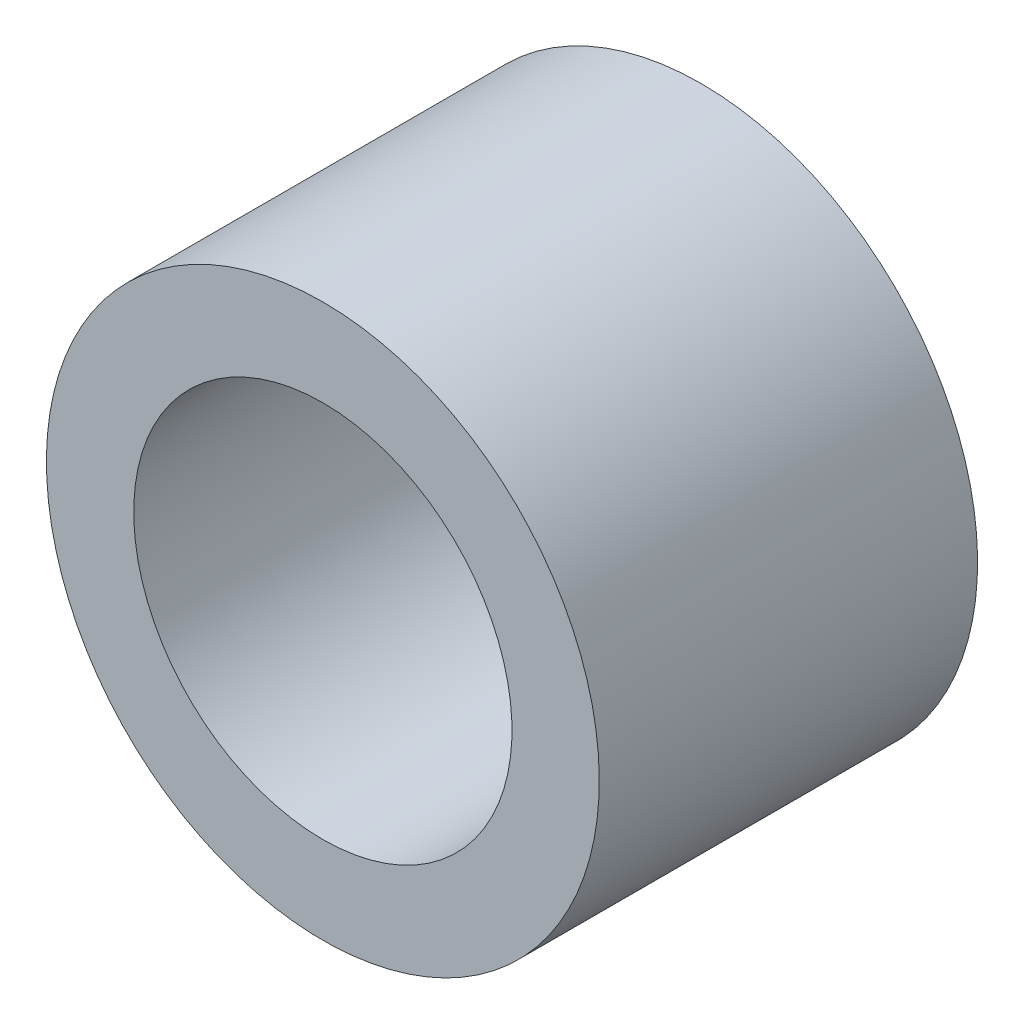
ISO-10303-21;
HEADER;
FILE_DESCRIPTION(('STEP AP214'),'2;1');
FILE_NAME('part.step','',(''),(''),'','','');
FILE_SCHEMA(('AUTOMOTIVE_DESIGN { 1 0 10303 214 1 1 1 1 }'));
ENDSEC;
DATA;
#1=APPLICATION_CONTEXT('core data for automotive mechanical design processes');
#2=APPLICATION_PROTOCOL_DEFINITION('international standard','automotive_design',2000,#1);
#3=PRODUCT_CONTEXT('',#1,'mechanical');
#4=PRODUCT('Part','Part','',(#3));
#5=PRODUCT_RELATED_PRODUCT_CATEGORY('part','',(#4));
#6=PRODUCT_DEFINITION_FORMATION('','',#4);
#7=PRODUCT_DEFINITION_CONTEXT('part definition',#1,'design');
#8=PRODUCT_DEFINITION('design','',#6,#7);
#9=PRODUCT_DEFINITION_SHAPE('','',#8);
#10=(LENGTH_UNIT() NAMED_UNIT(*) SI_UNIT(.MILLI.,.METRE.));
#11=(NAMED_UNIT(*) PLANE_ANGLE_UNIT() SI_UNIT($,.RADIAN.));
#12=(NAMED_UNIT(*) SI_UNIT($,.STERADIAN.) SOLID_ANGLE_UNIT());
#13=UNCERTAINTY_MEASURE_WITH_UNIT(LENGTH_MEASURE(1.E-05),#10,'distance_accuracy_value','');
#14=(GEOMETRIC_REPRESENTATION_CONTEXT(3) GLOBAL_UNCERTAINTY_ASSIGNED_CONTEXT((#13)) GLOBAL_UNIT_ASSIGNED_CONTEXT((#10,
#11,#12)) REPRESENTATION_CONTEXT('',''));
#15=CARTESIAN_POINT('',(0.,0.,0.));
#16=DIRECTION('',(0.,0.,1.));
#17=DIRECTION('',(1.,0.,0.));
#18=AXIS2_PLACEMENT_3D('',#15,#16,#17);
#19=CARTESIAN_POINT('',(9.5,0.,0.));
#20=DIRECTION('',(0.,0.,1.));
#21=DIRECTION('',(0.,-1.,0.));
#22=AXIS2_PLACEMENT_3D('',#19,#20,#21);
#23=PLANE('',#22);
#24=CARTESIAN_POINT('',(0.,0.,0.));
#25=DIRECTION('',(0.,0.,1.));
#26=DIRECTION('',(0.,-1.,0.));
#27=AXIS2_PLACEMENT_3D('',#24,#25,#26);
#28=CIRCLE('',#27,6.5);
#29=CARTESIAN_POINT('',(0.,-6.5,0.));
#30=VERTEX_POINT('',#29);
#31=EDGE_CURVE('E22',#30,#30,#28,.T.);
#32=ORIENTED_EDGE('',*,*,#31,.T.);
#33=EDGE_LOOP('',(#32));
#34=FACE_BOUND('',#33,.T.);
#35=CARTESIAN_POINT('',(0.,0.,0.));
#36=DIRECTION('',(0.,0.,-1.));
#37=DIRECTION('',(0.,1.,0.));
#38=AXIS2_PLACEMENT_3D('',#35,#36,#37);
#39=CIRCLE('',#38,9.5);
#40=CARTESIAN_POINT('',(0.,9.5,0.));
#41=VERTEX_POINT('',#40);
#42=EDGE_CURVE('E8',#41,#41,#39,.T.);
#43=ORIENTED_EDGE('',*,*,#42,.T.);
#44=EDGE_LOOP('',(#43));
#45=FACE_BOUND('',#44,.T.);
#46=ADVANCED_FACE('F12',(#34,#45),#23,.F.);
#47=CARTESIAN_POINT('',(0.,0.,-20.));
#48=DIRECTION('',(0.,0.,-1.));
#49=DIRECTION('',(0.,1.,0.));
#50=AXIS2_PLACEMENT_3D('',#47,#48,#49);
#51=CYLINDRICAL_SURFACE('',#50,9.5);
#52=ORIENTED_EDGE('',*,*,#42,.F.);
#53=EDGE_LOOP('',(#52));
#54=FACE_BOUND('',#53,.T.);
#55=CARTESIAN_POINT('',(0.,0.,13.));
#56=DIRECTION('',(0.,0.,-1.));
#57=DIRECTION('',(0.,1.,0.));
#58=AXIS2_PLACEMENT_3D('',#55,#56,#57);
#59=CIRCLE('',#58,9.5);
#60=CARTESIAN_POINT('',(0.,9.5,13.));
#61=VERTEX_POINT('',#60);
#62=EDGE_CURVE('E18',#61,#61,#59,.T.);
#63=ORIENTED_EDGE('',*,*,#62,.T.);
#64=EDGE_LOOP('',(#63));
#65=FACE_BOUND('',#64,.T.);
#66=ADVANCED_FACE('F37',(#54,#65),#51,.T.);
#67=CARTESIAN_POINT('',(0.,0.,13.));
#68=DIRECTION('',(0.,0.,-1.));
#69=DIRECTION('',(0.,1.,0.));
#70=AXIS2_PLACEMENT_3D('',#67,#68,#69);
#71=PLANE('',#70);
#72=CARTESIAN_POINT('',(0.,0.,13.));
#73=DIRECTION('',(0.,0.,1.));
#74=DIRECTION('',(0.,-1.,0.));
#75=AXIS2_PLACEMENT_3D('',#72,#73,#74);
#76=CIRCLE('',#75,6.5);
#77=CARTESIAN_POINT('',(0.,-6.5,13.));
#78=VERTEX_POINT('',#77);
#79=EDGE_CURVE('E26',#78,#78,#76,.T.);
#80=ORIENTED_EDGE('',*,*,#79,.F.);
#81=EDGE_LOOP('',(#80));
#82=FACE_BOUND('',#81,.T.);
#83=ORIENTED_EDGE('',*,*,#62,.F.);
#84=EDGE_LOOP('',(#83));
#85=FACE_BOUND('',#84,.T.);
#86=ADVANCED_FACE('F34',(#82,#85),#71,.F.);
#87=CARTESIAN_POINT('',(0.,0.,0.));
#88=DIRECTION('',(0.,0.,1.));
#89=DIRECTION('',(0.,-1.,0.));
#90=AXIS2_PLACEMENT_3D('',#87,#88,#89);
#91=CYLINDRICAL_SURFACE('',#90,6.5);
#92=ORIENTED_EDGE('',*,*,#31,.F.);
#93=EDGE_LOOP('',(#92));
#94=FACE_BOUND('',#93,.T.);
#95=ORIENTED_EDGE('',*,*,#79,.T.);
#96=EDGE_LOOP('',(#95));
#97=FACE_BOUND('',#96,.T.);
#98=ADVANCED_FACE('F32',(#94,#97),#91,.F.);
#99=CLOSED_SHELL('',(#46,#66,#86,#98));
#100=MANIFOLD_SOLID_BREP('B1',#99);
#101=ADVANCED_BREP_SHAPE_REPRESENTATION('',(#18,#100),#14);
#102=SHAPE_DEFINITION_REPRESENTATION(#9,#101);
ENDSEC;
END-ISO-10303-21;
